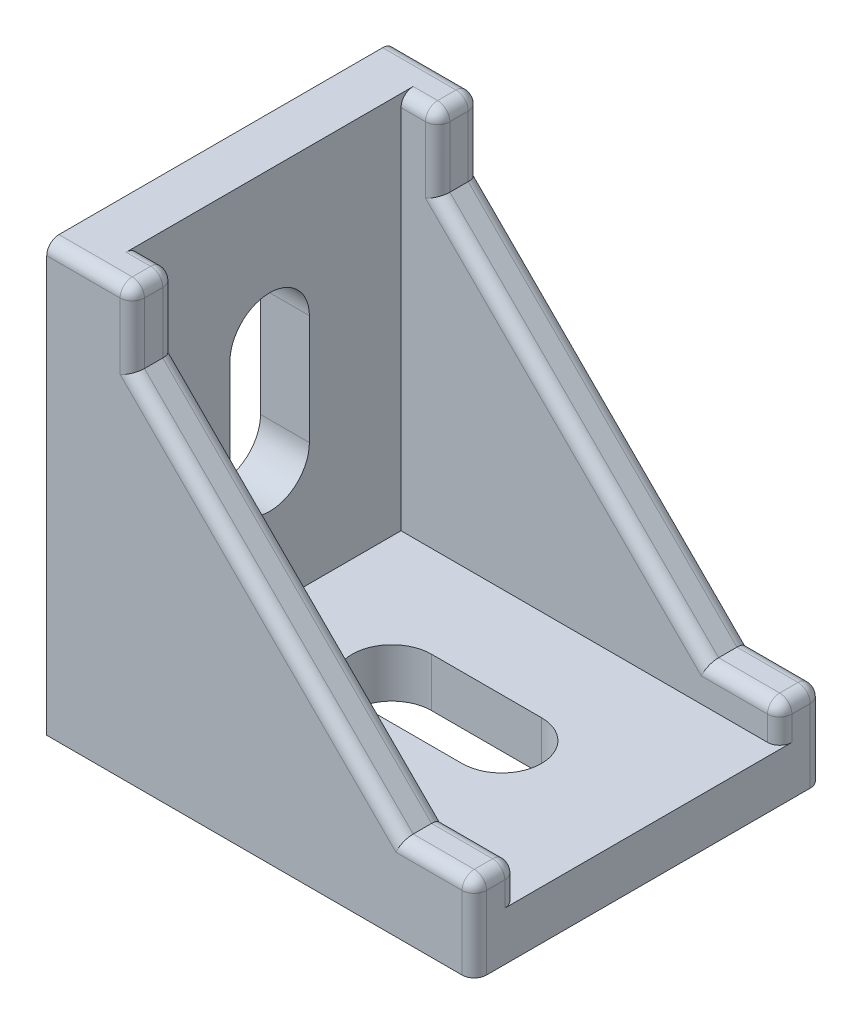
from build123d import *

# Parameters (mm, degrees)
EXTRUDE_1_DEPTH     = 25
EXTRUDE_2_DEPTH     = 3.5
CUT_EXTRUDE_1_DEPTH = 49.296693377
SKETCH_5_W          = 7.8
SKETCH_5_H          = 2
EXTRUDE_3_DEPTH     = 2
SKETCH_6_W          = 7.8
SKETCH_6_H          = 2
EXTRUDE_4_DEPTH     = 2
CUT_EXTRUDE_2_DEPTH = 2
CUT_EXTRUDE_3_DEPTH = 2
FILLET_1_R          = 1
FILLET_2_R          = 1
FILLET_3_R          = 1
FILLET_4_R          = 1
FILLET_5_R          = 1
FILLET_6_R          = 1
FILLET_7_R          = 1
FILLET_8_R          = 1
FILLET_9_R          = 1
FILLET_10_R         = 1
FILLET_11_R         = 1
FILLET_12_R         = 1
FILLET_13_R         = 1
FILLET_14_R         = 1
FILLET_15_R         = 1
FILLET_16_R         = 1
FILLET_17_R         = 0.5
FILLET_18_R         = 0.5
FILLET_19_R         = 0.5
FILLET_20_R         = 0.5
FILLET_21_R         = 0.5
FILLET_22_R         = 0.5
FILLET_23_R         = 0.5
FILLET_24_R         = 0.5


with BuildPart() as part:
    # Sketch 1 → Extrude 1 (new body)
    with BuildSketch(Plane.XY):
        Polygon((-35, 7.676556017), (-31, 7.676556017), (-31, -23.323443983), (0, -23.323443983), (0, -27.323443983), (-35, -27.323443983), align=None)
    extrude_1 = extrude(amount=EXTRUDE_1_DEPTH)

    # Sketch 2 → Extrude 2 (add)
    with BuildSketch(Plane.XY.offset(25)):
        Polygon((-31, 7.676556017), (-28, 7.676556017), (-28, 1.676556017), (-6, -20.323443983), (0, -20.323443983), (0, -23.323443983), (-31, -23.323443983), align=None)
    extrude_2 = extrude(amount=-EXTRUDE_2_DEPTH)

    # Mirror 4: Extrude 1, Extrude 2 across plane
    add(extrude_1.mirror(Plane.XY.offset(10.75)))
    add(extrude_2.mirror(Plane.XY.offset(10.75)))

    # Sketch 4 → Cut-Extrude 1 (cut, through all)
    with BuildSketch(Plane(origin=(-31, 0, 0), x_dir=(0, 0, -1), z_dir=(1, 0, 0))):
        with BuildLine():
            Line((-10.75, -16.573443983), (-10.75, -1.073443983))
            ThreePointArc((-10.75, -1.073443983), (-13.048097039, -2.025346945), (-14, -4.323443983))
            Line((-14, -4.323443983), (-14, -13.323443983))
            ThreePointArc((-14, -13.323443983), (-13.048097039, -15.621541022), (-10.75, -16.573443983))
        make_face()
        with BuildLine():
            ThreePointArc((-7.5, -4.323443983), (-8.451902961, -2.025346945), (-10.75, -1.073443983))
            Line((-10.75, -1.073443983), (-10.75, -16.573443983))
            ThreePointArc((-10.75, -16.573443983), (-8.451902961, -15.621541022), (-7.5, -13.323443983))
            Line((-7.5, -13.323443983), (-7.5, -4.323443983))
        make_face()
    cut_extrude_1 = extrude(amount=-CUT_EXTRUDE_1_DEPTH, mode=Mode.SUBTRACT)

    # Sketch 5 → Extrude 3 (add)
    with BuildSketch(Plane.ZY.offset(35)):
        with Locations((10.75, 3.676556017)):
            Rectangle(SKETCH_5_W, SKETCH_5_H)
    extrude_3 = extrude(amount=EXTRUDE_3_DEPTH)

    # Sketch 6 → Extrude 4 (add)
    with BuildSketch(Plane.ZY.offset(35)):
        with Locations((10.75, -23.823443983)):
            Rectangle(SKETCH_6_W, SKETCH_6_H)
    extrude_4 = extrude(amount=EXTRUDE_4_DEPTH)

    # Sketch 7 → Cut-Extrude 2 (cut)
    with BuildSketch(Plane.ZY.offset(35)):
        Polygon((6.85, 4.676556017), (4.5, 4.676556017), (4.5, -0.323443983), (17, -0.323443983), (17, 4.676556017), (14.65, 4.676556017), (14.65, 2.676556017), (6.85, 2.676556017), align=None)
    cut_extrude_2 = extrude(amount=-CUT_EXTRUDE_2_DEPTH, mode=Mode.SUBTRACT)

    # Sketch 8 → Cut-Extrude 3 (cut)
    with BuildSketch(Plane.ZY.offset(35)):
        Polygon((14.65, -24.823443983), (17, -24.823443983), (17, -19.823443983), (4.5, -19.823443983), (4.5, -24.823443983), (6.85, -24.823443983), (6.85, -22.823443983), (14.65, -22.823443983), align=None)
    cut_extrude_3 = extrude(amount=-CUT_EXTRUDE_3_DEPTH, mode=Mode.SUBTRACT)

    # Mirror 5: Extrude 3, Extrude 4, Cut-Extrude 2, Cut-Extrude 3 across plane
    add(extrude_3.mirror(Plane(origin=(-3.838278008, 3.838278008, 0), x_dir=(0, 0, 1), z_dir=(0.7071067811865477, -0.7071067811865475, 0))))
    add(extrude_4.mirror(Plane(origin=(-3.838278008, 3.838278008, 0), x_dir=(0, 0, 1), z_dir=(0.7071067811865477, -0.7071067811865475, 0))))
    add(cut_extrude_2.mirror(Plane(origin=(-3.838278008, 3.838278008, 0), x_dir=(0, 0, 1), z_dir=(0.7071067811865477, -0.7071067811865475, 0))), mode=Mode.SUBTRACT)
    add(cut_extrude_3.mirror(Plane(origin=(-3.838278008, 3.838278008, 0), x_dir=(0, 0, 1), z_dir=(0.7071067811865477, -0.7071067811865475, 0))), mode=Mode.SUBTRACT)

    # Mirror 6: Cut-Extrude 1 across plane
    add(cut_extrude_1.mirror(Plane(origin=(-3.838278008, 3.838278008, 0), x_dir=(0, 0, 1), z_dir=(0.7071067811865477, -0.7071067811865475, 0))), mode=Mode.SUBTRACT)

    # Fillet 1
    fillet_1_edges = [part.edges().sort_by_distance(p)[0] for p in [
        (-17, -9.323443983, 25),
    ]]
    fillet(fillet_1_edges, radius=FILLET_1_R)

    # Fillet 2
    fillet_2_edges = [part.edges().sort_by_distance(p)[0] for p in [
        (-17, -9.323443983, 21.5),
    ]]
    fillet(fillet_2_edges, radius=FILLET_2_R)

    # Fillet 3
    fillet_3_edges = [part.edges().sort_by_distance(p)[0] for p in [
        (-3.707106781, -20.323443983, 25),
    ]]
    fillet(fillet_3_edges, radius=FILLET_3_R)

    # Fillet 4
    fillet_4_edges = [part.edges().sort_by_distance(p)[0] for p in [
        (-3.707106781, -20.323443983, 21.5),
    ]]
    fillet(fillet_4_edges, radius=FILLET_4_R)

    # Fillet 5
    fillet_5_edges = [part.edges().sort_by_distance(p)[0] for p in [
        (0, -24.323443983, 25),
        (0, -22.323443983, 21.5),
        (0, -20.616337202, 24.707106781),
        (0, -20.323443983, 23.25),
        (0, -20.616337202, 21.792893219),
    ]]
    fillet(fillet_5_edges, radius=FILLET_5_R)

    # Fillet 6
    fillet_6_edges = [part.edges().sort_by_distance(p)[0] for p in [
        (-28, 7.676556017, 23.25),
    ]]
    fillet(fillet_6_edges, radius=FILLET_6_R)

    # Fillet 7
    fillet_7_edges = [part.edges().sort_by_distance(p)[0] for p in [
        (-32, 7.676556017, 25),
        (-28.292893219, 7.383662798, 25),
        (-28, 3.469449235, 25),
    ]]
    fillet(fillet_7_edges, radius=FILLET_7_R)

    # Fillet 8
    fillet_8_edges = [part.edges().sort_by_distance(p)[0] for p in [
        (-30, 7.676556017, 21.5),
        (-28.292893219, 7.383662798, 21.5),
        (-28, 3.469449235, 21.5),
    ]]
    fillet(fillet_8_edges, radius=FILLET_8_R)

    # Fillet 9
    fillet_9_edges = [part.edges().sort_by_distance(p)[0] for p in [
        (-31.5, 7.676556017, -3.5),
    ]]
    fillet(fillet_9_edges, radius=FILLET_9_R)

    # Fillet 10
    fillet_10_edges = [part.edges().sort_by_distance(p)[0] for p in [
        (-29.5, 7.676556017, 0),
    ]]
    fillet(fillet_10_edges, radius=FILLET_10_R)

    # Fillet 11
    fillet_11_edges = [part.edges().sort_by_distance(p)[0] for p in [
        (-28, 7.383662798, -3.207106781),
        (-28, 7.676556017, -1.75),
        (-28, 7.383662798, -0.292893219),
        (-28, 4.176556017, -3.5),
        (-28, 4.176556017, 0),
    ]]
    fillet(fillet_11_edges, radius=FILLET_11_R)

    # Fillet 12
    fillet_12_edges = [part.edges().sort_by_distance(p)[0] for p in [
        (-17.5, -8.823443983, 0),
    ]]
    fillet(fillet_12_edges, radius=FILLET_12_R)

    # Fillet 13
    fillet_13_edges = [part.edges().sort_by_distance(p)[0] for p in [
        (-17.5, -8.823443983, -3.5),
    ]]
    fillet(fillet_13_edges, radius=FILLET_13_R)

    # Fillet 14
    fillet_14_edges = [part.edges().sort_by_distance(p)[0] for p in [
        (-3.707106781, -20.323443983, 0),
    ]]
    fillet(fillet_14_edges, radius=FILLET_14_R)

    # Fillet 15
    fillet_15_edges = [part.edges().sort_by_distance(p)[0] for p in [
        (-3.707106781, -20.323443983, -3.5),
    ]]
    fillet(fillet_15_edges, radius=FILLET_15_R)

    # Fillet 16
    fillet_16_edges = [part.edges().sort_by_distance(p)[0] for p in [
        (0, -20.323443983, -1.75),
        (0, -20.616337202, -0.292893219),
        (0, -20.616337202, -3.207106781),
        (0, -24.323443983, -3.5),
        (0, -22.323443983, 0),
    ]]
    fillet(fillet_16_edges, radius=FILLET_16_R)

    # Fillet 17
    fillet_17_edges = [part.edges().sort_by_distance(p)[0] for p in [
        (-3, -29.323443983, 10.75),
    ]]
    fillet(fillet_17_edges, radius=FILLET_17_R)

    # Fillet 18
    fillet_18_edges = [part.edges().sort_by_distance(p)[0] for p in [
        (-5, -29.323443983, 10.75),
    ]]
    fillet(fillet_18_edges, radius=FILLET_18_R)

    # Fillet 19
    fillet_19_edges = [part.edges().sort_by_distance(p)[0] for p in [
        (-32.5, -29.323443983, 10.75),
    ]]
    fillet(fillet_19_edges, radius=FILLET_19_R)

    # Fillet 20
    fillet_20_edges = [part.edges().sort_by_distance(p)[0] for p in [
        (-30.5, -29.323443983, 10.75),
    ]]
    fillet(fillet_20_edges, radius=FILLET_20_R)

    # Fillet 21
    fillet_21_edges = [part.edges().sort_by_distance(p)[0] for p in [
        (-37, -22.823443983, 10.75),
    ]]
    fillet(fillet_21_edges, radius=FILLET_21_R)

    # Fillet 22
    fillet_22_edges = [part.edges().sort_by_distance(p)[0] for p in [
        (-37, -24.823443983, 10.75),
    ]]
    fillet(fillet_22_edges, radius=FILLET_22_R)

    # Fillet 23
    fillet_23_edges = [part.edges().sort_by_distance(p)[0] for p in [
        (-37, 4.676556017, 10.75),
    ]]
    fillet(fillet_23_edges, radius=FILLET_23_R)

    # Fillet 24
    fillet_24_edges = [part.edges().sort_by_distance(p)[0] for p in [
        (-37, 2.676556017, 10.75),
    ]]
    fillet(fillet_24_edges, radius=FILLET_24_R)


solid = part.part
